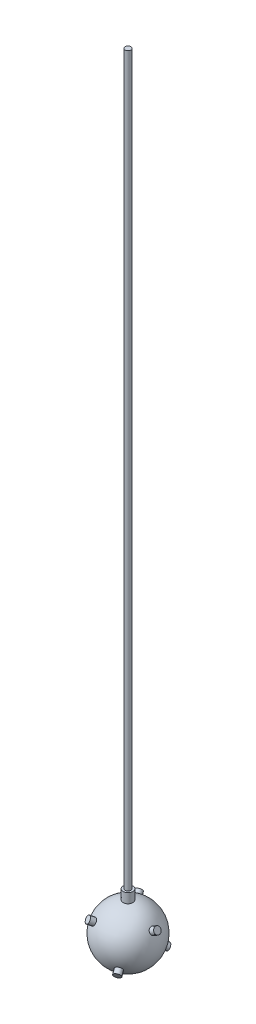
ISO-10303-21;
HEADER;
FILE_DESCRIPTION(('STEP AP214'),'2;1');
FILE_NAME('part.step','',(''),(''),'','','');
FILE_SCHEMA(('AUTOMOTIVE_DESIGN { 1 0 10303 214 1 1 1 1 }'));
ENDSEC;
DATA;
#1=APPLICATION_CONTEXT('core data for automotive mechanical design processes');
#2=APPLICATION_PROTOCOL_DEFINITION('international standard','automotive_design',2000,#1);
#3=PRODUCT_CONTEXT('',#1,'mechanical');
#4=PRODUCT('Part','Part','',(#3));
#5=PRODUCT_RELATED_PRODUCT_CATEGORY('part','',(#4));
#6=PRODUCT_DEFINITION_FORMATION('','',#4);
#7=PRODUCT_DEFINITION_CONTEXT('part definition',#1,'design');
#8=PRODUCT_DEFINITION('design','',#6,#7);
#9=PRODUCT_DEFINITION_SHAPE('','',#8);
#10=(LENGTH_UNIT() NAMED_UNIT(*) SI_UNIT(.MILLI.,.METRE.));
#11=(NAMED_UNIT(*) PLANE_ANGLE_UNIT() SI_UNIT($,.RADIAN.));
#12=(NAMED_UNIT(*) SI_UNIT($,.STERADIAN.) SOLID_ANGLE_UNIT());
#13=UNCERTAINTY_MEASURE_WITH_UNIT(LENGTH_MEASURE(1.E-05),#10,'distance_accuracy_value','');
#14=(GEOMETRIC_REPRESENTATION_CONTEXT(3) GLOBAL_UNCERTAINTY_ASSIGNED_CONTEXT((#13)) GLOBAL_UNIT_ASSIGNED_CONTEXT((#10,
#11,#12)) REPRESENTATION_CONTEXT('',''));
#15=CARTESIAN_POINT('',(0.,0.,0.));
#16=DIRECTION('',(0.,0.,1.));
#17=DIRECTION('',(1.,0.,0.));
#18=AXIS2_PLACEMENT_3D('',#15,#16,#17);
#19=CARTESIAN_POINT('',(30.3108891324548,-35.0000000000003,52.5000000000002));
#20=DIRECTION('',(-0.433012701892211,0.500000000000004,-0.750000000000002));
#21=DIRECTION('',(0.249999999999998,0.866025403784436,0.433012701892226));
#22=AXIS2_PLACEMENT_3D('',#19,#20,#21);
#23=PLANE('',#22);
#24=CARTESIAN_POINT('',(30.3108891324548,-35.0000000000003,52.5000000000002));
#25=DIRECTION('',(-0.433012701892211,0.500000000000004,-0.750000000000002));
#26=DIRECTION('',(0.249999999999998,0.866025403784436,0.433012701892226));
#27=AXIS2_PLACEMENT_3D('',#24,#25,#26);
#28=CIRCLE('',#27,7.);
#29=CARTESIAN_POINT('',(32.0608891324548,-28.9378221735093,55.5310889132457));
#30=VERTEX_POINT('',#29);
#31=EDGE_CURVE('E88',#30,#30,#28,.T.);
#32=ORIENTED_EDGE('',*,*,#31,.F.);
#33=EDGE_LOOP('',(#32));
#34=FACE_BOUND('',#33,.T.);
#35=ADVANCED_FACE('F76',(#34),#23,.F.);
#36=CARTESIAN_POINT('',(-30.310889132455,34.9999999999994,-52.5000000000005));
#37=DIRECTION('',(-0.433012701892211,0.500000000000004,-0.750000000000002));
#38=DIRECTION('',(0.249999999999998,0.866025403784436,0.433012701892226));
#39=AXIS2_PLACEMENT_3D('',#36,#37,#38);
#40=PLANE('',#39);
#41=CARTESIAN_POINT('',(-30.310889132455,34.9999999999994,-52.5000000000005));
#42=DIRECTION('',(-0.433012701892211,0.500000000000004,-0.750000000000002));
#43=DIRECTION('',(0.249999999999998,0.866025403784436,0.433012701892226));
#44=AXIS2_PLACEMENT_3D('',#41,#42,#43);
#45=CIRCLE('',#44,7.);
#46=CARTESIAN_POINT('',(-28.560889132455,41.0621778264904,-49.4689110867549));
#47=VERTEX_POINT('',#46);
#48=EDGE_CURVE('E15',#47,#47,#45,.T.);
#49=ORIENTED_EDGE('',*,*,#48,.T.);
#50=EDGE_LOOP('',(#49));
#51=FACE_BOUND('',#50,.T.);
#52=ADVANCED_FACE('F91',(#51),#40,.T.);
#53=CARTESIAN_POINT('',(30.3108891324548,-35.0000000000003,52.5000000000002));
#54=DIRECTION('',(-0.433012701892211,0.500000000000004,-0.750000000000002));
#55=DIRECTION('',(0.249999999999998,0.866025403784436,0.433012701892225));
#56=AXIS2_PLACEMENT_3D('',#53,#54,#55);
#57=CYLINDRICAL_SURFACE('',#56,7.);
#58=CARTESIAN_POINT('',(0.,0.,0.));
#59=DIRECTION('',(-0.433012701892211,0.500000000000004,-0.750000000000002));
#60=DIRECTION('',(0.249999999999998,0.866025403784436,0.433012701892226));
#61=AXIS2_PLACEMENT_3D('',#58,#59,#60);
#62=CIRCLE('',#61,7.);
#63=CARTESIAN_POINT('',(1.75,6.06217782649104,3.0310889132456));
#64=VERTEX_POINT('',#63);
#65=EDGE_CURVE('E83',#64,#64,#62,.T.);
#66=ORIENTED_EDGE('',*,*,#65,.F.);
#67=EDGE_LOOP('',(#66));
#68=FACE_BOUND('',#67,.T.);
#69=ORIENTED_EDGE('',*,*,#31,.T.);
#70=EDGE_LOOP('',(#69));
#71=FACE_BOUND('',#70,.T.);
#72=ADVANCED_FACE('F96',(#68,#71),#57,.T.);
#73=CARTESIAN_POINT('',(-1.11022302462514E-13,-4.57966997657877E-13,-1.92296268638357E-13));
#74=DIRECTION('',(-0.433012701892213,0.499999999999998,-0.750000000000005));
#75=DIRECTION('',(0.249999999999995,0.86602540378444,0.43301270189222));
#76=AXIS2_PLACEMENT_3D('',#73,#74,#75);
#77=CYLINDRICAL_SURFACE('',#76,7.);
#78=ORIENTED_EDGE('',*,*,#48,.F.);
#79=EDGE_LOOP('',(#78));
#80=FACE_BOUND('',#79,.T.);
#81=ORIENTED_EDGE('',*,*,#65,.T.);
#82=EDGE_LOOP('',(#81));
#83=FACE_BOUND('',#82,.T.);
#84=ADVANCED_FACE('F93',(#80,#83),#77,.T.);
#85=CLOSED_SHELL('',(#35,#52,#72,#84));
#86=MANIFOLD_SOLID_BREP('B2',#85);
#87=CARTESIAN_POINT('',(30.3108891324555,-35.0000000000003,-52.4999999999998));
#88=DIRECTION('',(-0.433012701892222,0.500000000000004,0.749999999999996));
#89=DIRECTION('',(0.250000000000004,0.866025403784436,-0.433012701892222));
#90=AXIS2_PLACEMENT_3D('',#87,#88,#89);
#91=PLANE('',#90);
#92=CARTESIAN_POINT('',(30.3108891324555,-35.0000000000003,-52.4999999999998));
#93=DIRECTION('',(-0.433012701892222,0.500000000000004,0.749999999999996));
#94=DIRECTION('',(0.250000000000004,0.866025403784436,-0.433012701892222));
#95=AXIS2_PLACEMENT_3D('',#92,#93,#94);
#96=CIRCLE('',#95,7.);
#97=CARTESIAN_POINT('',(32.0608891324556,-28.9378221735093,-55.5310889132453));
#98=VERTEX_POINT('',#97);
#99=EDGE_CURVE('E166',#98,#98,#96,.T.);
#100=ORIENTED_EDGE('',*,*,#99,.F.);
#101=EDGE_LOOP('',(#100));
#102=FACE_BOUND('',#101,.T.);
#103=ADVANCED_FACE('F154',(#102),#91,.F.);
#104=CARTESIAN_POINT('',(-30.3108891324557,34.9999999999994,52.5000000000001));
#105=DIRECTION('',(-0.433012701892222,0.500000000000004,0.749999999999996));
#106=DIRECTION('',(0.250000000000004,0.866025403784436,-0.433012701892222));
#107=AXIS2_PLACEMENT_3D('',#104,#105,#106);
#108=PLANE('',#107);
#109=CARTESIAN_POINT('',(-30.3108891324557,34.9999999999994,52.5000000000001));
#110=DIRECTION('',(-0.433012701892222,0.500000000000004,0.749999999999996));
#111=DIRECTION('',(0.250000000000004,0.866025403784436,-0.433012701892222));
#112=AXIS2_PLACEMENT_3D('',#109,#110,#111);
#113=CIRCLE('',#112,7.);
#114=CARTESIAN_POINT('',(-28.5608891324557,41.0621778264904,49.4689110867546));
#115=VERTEX_POINT('',#114);
#116=EDGE_CURVE('E74',#115,#115,#113,.T.);
#117=ORIENTED_EDGE('',*,*,#116,.T.);
#118=EDGE_LOOP('',(#117));
#119=FACE_BOUND('',#118,.T.);
#120=ADVANCED_FACE('F169',(#119),#108,.T.);
#121=CARTESIAN_POINT('',(30.3108891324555,-35.0000000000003,-52.4999999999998));
#122=DIRECTION('',(-0.433012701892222,0.500000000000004,0.749999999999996));
#123=DIRECTION('',(0.250000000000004,0.866025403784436,-0.433012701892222));
#124=AXIS2_PLACEMENT_3D('',#121,#122,#123);
#125=CYLINDRICAL_SURFACE('',#124,7.);
#126=CARTESIAN_POINT('',(0.,0.,0.));
#127=DIRECTION('',(-0.433012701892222,0.500000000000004,0.749999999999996));
#128=DIRECTION('',(0.250000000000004,0.866025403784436,-0.433012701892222));
#129=AXIS2_PLACEMENT_3D('',#126,#127,#128);
#130=CIRCLE('',#129,7.);
#131=CARTESIAN_POINT('',(1.75000000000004,6.06217782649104,-3.03108891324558));
#132=VERTEX_POINT('',#131);
#133=EDGE_CURVE('E161',#132,#132,#130,.T.);
#134=ORIENTED_EDGE('',*,*,#133,.F.);
#135=EDGE_LOOP('',(#134));
#136=FACE_BOUND('',#135,.T.);
#137=ORIENTED_EDGE('',*,*,#99,.T.);
#138=EDGE_LOOP('',(#137));
#139=FACE_BOUND('',#138,.T.);
#140=ADVANCED_FACE('F174',(#136,#139),#125,.T.);
#141=CARTESIAN_POINT('',(-1.11022302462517E-13,-4.57966997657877E-13,1.92296268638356E-13));
#142=DIRECTION('',(-0.433012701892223,0.499999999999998,0.749999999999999));
#143=DIRECTION('',(0.250000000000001,0.86602540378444,-0.433012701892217));
#144=AXIS2_PLACEMENT_3D('',#141,#142,#143);
#145=CYLINDRICAL_SURFACE('',#144,7.);
#146=ORIENTED_EDGE('',*,*,#116,.F.);
#147=EDGE_LOOP('',(#146));
#148=FACE_BOUND('',#147,.T.);
#149=ORIENTED_EDGE('',*,*,#133,.T.);
#150=EDGE_LOOP('',(#149));
#151=FACE_BOUND('',#150,.T.);
#152=ADVANCED_FACE('F171',(#148,#151),#145,.T.);
#153=CLOSED_SHELL('',(#103,#120,#140,#152));
#154=MANIFOLD_SOLID_BREP('B9',#153);
#155=CARTESIAN_POINT('',(-60.6217782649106,-35.0000000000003,0.));
#156=DIRECTION('',(0.866025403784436,0.500000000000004,0.));
#157=DIRECTION('',(-0.500000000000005,0.866025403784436,0.));
#158=AXIS2_PLACEMENT_3D('',#155,#156,#157);
#159=PLANE('',#158);
#160=CARTESIAN_POINT('',(-60.6217782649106,-35.0000000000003,0.));
#161=DIRECTION('',(0.866025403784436,0.500000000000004,0.));
#162=DIRECTION('',(-0.500000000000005,0.866025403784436,0.));
#163=AXIS2_PLACEMENT_3D('',#160,#161,#162);
#164=CIRCLE('',#163,7.);
#165=CARTESIAN_POINT('',(-64.1217782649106,-28.9378221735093,0.));
#166=VERTEX_POINT('',#165);
#167=EDGE_CURVE('E241',#166,#166,#164,.T.);
#168=ORIENTED_EDGE('',*,*,#167,.F.);
#169=EDGE_LOOP('',(#168));
#170=FACE_BOUND('',#169,.T.);
#171=ADVANCED_FACE('F229',(#170),#159,.F.);
#172=CARTESIAN_POINT('',(60.621778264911,34.9999999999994,0.));
#173=DIRECTION('',(0.866025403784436,0.500000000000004,0.));
#174=DIRECTION('',(-0.500000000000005,0.866025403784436,0.));
#175=AXIS2_PLACEMENT_3D('',#172,#173,#174);
#176=PLANE('',#175);
#177=CARTESIAN_POINT('',(60.621778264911,34.9999999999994,0.));
#178=DIRECTION('',(0.866025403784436,0.500000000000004,0.));
#179=DIRECTION('',(-0.500000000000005,0.866025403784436,0.));
#180=AXIS2_PLACEMENT_3D('',#177,#178,#179);
#181=CIRCLE('',#180,7.);
#182=CARTESIAN_POINT('',(57.1217782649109,41.0621778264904,0.));
#183=VERTEX_POINT('',#182);
#184=EDGE_CURVE('E152',#183,#183,#181,.T.);
#185=ORIENTED_EDGE('',*,*,#184,.T.);
#186=EDGE_LOOP('',(#185));
#187=FACE_BOUND('',#186,.T.);
#188=ADVANCED_FACE('F244',(#187),#176,.T.);
#189=CARTESIAN_POINT('',(-60.6217782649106,-35.0000000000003,0.));
#190=DIRECTION('',(0.866025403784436,0.500000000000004,0.));
#191=DIRECTION('',(-0.500000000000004,0.866025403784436,0.));
#192=AXIS2_PLACEMENT_3D('',#189,#190,#191);
#193=CYLINDRICAL_SURFACE('',#192,7.);
#194=CARTESIAN_POINT('',(0.,0.,0.));
#195=DIRECTION('',(0.866025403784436,0.500000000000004,0.));
#196=DIRECTION('',(-0.500000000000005,0.866025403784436,0.));
#197=AXIS2_PLACEMENT_3D('',#194,#195,#196);
#198=CIRCLE('',#197,7.);
#199=CARTESIAN_POINT('',(-3.50000000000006,6.06217782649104,0.));
#200=VERTEX_POINT('',#199);
#201=EDGE_CURVE('E236',#200,#200,#198,.T.);
#202=ORIENTED_EDGE('',*,*,#201,.F.);
#203=EDGE_LOOP('',(#202));
#204=FACE_BOUND('',#203,.T.);
#205=ORIENTED_EDGE('',*,*,#167,.T.);
#206=EDGE_LOOP('',(#205));
#207=FACE_BOUND('',#206,.T.);
#208=ADVANCED_FACE('F249',(#204,#207),#193,.T.);
#209=CARTESIAN_POINT('',(2.22044604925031E-13,-4.57966997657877E-13,0.));
#210=DIRECTION('',(0.86602540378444,0.499999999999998,0.));
#211=DIRECTION('',(-0.499999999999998,0.86602540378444,0.));
#212=AXIS2_PLACEMENT_3D('',#209,#210,#211);
#213=CYLINDRICAL_SURFACE('',#212,7.);
#214=ORIENTED_EDGE('',*,*,#184,.F.);
#215=EDGE_LOOP('',(#214));
#216=FACE_BOUND('',#215,.T.);
#217=ORIENTED_EDGE('',*,*,#201,.T.);
#218=EDGE_LOOP('',(#217));
#219=FACE_BOUND('',#218,.T.);
#220=ADVANCED_FACE('F246',(#216,#219),#213,.T.);
#221=CLOSED_SHELL('',(#171,#188,#208,#220));
#222=MANIFOLD_SOLID_BREP('B68',#221);
#223=CARTESIAN_POINT('',(0.,0.,0.));
#224=DIRECTION('',(0.,-1.,0.));
#225=DIRECTION('',(-1.,0.,0.));
#226=AXIS2_PLACEMENT_3D('',#223,#224,#225);
#227=SPHERICAL_SURFACE('',#226,60.);
#228=CARTESIAN_POINT('',(0.,59.1607978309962,0.));
#229=DIRECTION('',(0.,-1.,0.));
#230=DIRECTION('',(0.,0.,-1.));
#231=AXIS2_PLACEMENT_3D('',#228,#229,#230);
#232=CIRCLE('',#231,10.);
#233=CARTESIAN_POINT('',(0.,59.1607978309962,-10.));
#234=VERTEX_POINT('',#233);
#235=EDGE_CURVE('E298',#234,#234,#232,.F.);
#236=ORIENTED_EDGE('',*,*,#235,.F.);
#237=EDGE_LOOP('',(#236));
#238=FACE_BOUND('',#237,.T.);
#239=ADVANCED_FACE('F295',(#238),#227,.T.);
#240=CARTESIAN_POINT('',(0.,0.,0.));
#241=DIRECTION('',(0.,-1.,0.));
#242=DIRECTION('',(0.,0.,-1.));
#243=AXIS2_PLACEMENT_3D('',#240,#241,#242);
#244=CYLINDRICAL_SURFACE('',#243,10.);
#245=CARTESIAN_POINT('',(0.,79.1607978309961,0.));
#246=DIRECTION('',(0.,-1.,0.));
#247=DIRECTION('',(0.,0.,-1.));
#248=AXIS2_PLACEMENT_3D('',#245,#246,#247);
#249=CIRCLE('',#248,10.);
#250=CARTESIAN_POINT('',(0.,79.1607978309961,-10.));
#251=VERTEX_POINT('',#250);
#252=EDGE_CURVE('E306',#251,#251,#249,.T.);
#253=ORIENTED_EDGE('',*,*,#252,.T.);
#254=EDGE_LOOP('',(#253));
#255=FACE_BOUND('',#254,.T.);
#256=ORIENTED_EDGE('',*,*,#235,.T.);
#257=EDGE_LOOP('',(#256));
#258=FACE_BOUND('',#257,.T.);
#259=ADVANCED_FACE('F326',(#255,#258),#244,.T.);
#260=CARTESIAN_POINT('',(0.,79.1607978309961,0.));
#261=DIRECTION('',(0.,1.,0.));
#262=DIRECTION('',(0.,0.,1.));
#263=AXIS2_PLACEMENT_3D('',#260,#261,#262);
#264=PLANE('',#263);
#265=CARTESIAN_POINT('',(0.,79.1607978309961,0.));
#266=DIRECTION('',(0.,1.,0.));
#267=DIRECTION('',(0.,0.,1.));
#268=AXIS2_PLACEMENT_3D('',#265,#266,#267);
#269=CIRCLE('',#268,6.);
#270=CARTESIAN_POINT('',(0.,79.1607978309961,6.));
#271=VERTEX_POINT('',#270);
#272=EDGE_CURVE('E228',#271,#271,#269,.T.);
#273=ORIENTED_EDGE('',*,*,#272,.F.);
#274=EDGE_LOOP('',(#273));
#275=FACE_BOUND('',#274,.T.);
#276=ORIENTED_EDGE('',*,*,#252,.F.);
#277=EDGE_LOOP('',(#276));
#278=FACE_BOUND('',#277,.T.);
#279=ADVANCED_FACE('F319',(#275,#278),#264,.T.);
#280=CARTESIAN_POINT('',(0.,1579.160797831,0.));
#281=DIRECTION('',(0.,-1.,0.));
#282=DIRECTION('',(0.,0.,-1.));
#283=AXIS2_PLACEMENT_3D('',#280,#281,#282);
#284=CYLINDRICAL_SURFACE('',#283,6.);
#285=CARTESIAN_POINT('',(0.,1579.160797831,0.));
#286=DIRECTION('',(0.,1.,0.));
#287=DIRECTION('',(0.,0.,1.));
#288=AXIS2_PLACEMENT_3D('',#285,#286,#287);
#289=CIRCLE('',#288,6.);
#290=CARTESIAN_POINT('',(0.,1579.160797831,6.));
#291=VERTEX_POINT('',#290);
#292=EDGE_CURVE('E308',#291,#291,#289,.T.);
#293=ORIENTED_EDGE('',*,*,#292,.F.);
#294=EDGE_LOOP('',(#293));
#295=FACE_BOUND('',#294,.T.);
#296=ORIENTED_EDGE('',*,*,#272,.T.);
#297=EDGE_LOOP('',(#296));
#298=FACE_BOUND('',#297,.T.);
#299=ADVANCED_FACE('F317',(#295,#298),#284,.T.);
#300=CARTESIAN_POINT('',(0.,1579.160797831,0.));
#301=DIRECTION('',(0.,1.,0.));
#302=DIRECTION('',(0.,0.,1.));
#303=AXIS2_PLACEMENT_3D('',#300,#301,#302);
#304=PLANE('',#303);
#305=ORIENTED_EDGE('',*,*,#292,.T.);
#306=EDGE_LOOP('',(#305));
#307=FACE_BOUND('',#306,.T.);
#308=ADVANCED_FACE('F315',(#307),#304,.T.);
#309=CLOSED_SHELL('',(#239,#259,#279,#299,#308));
#310=MANIFOLD_SOLID_BREP('B146',#309);
#311=ADVANCED_BREP_SHAPE_REPRESENTATION('',(#18,#86,#154,#222,#310),#14);
#312=SHAPE_DEFINITION_REPRESENTATION(#9,#311);
ENDSEC;
END-ISO-10303-21;
